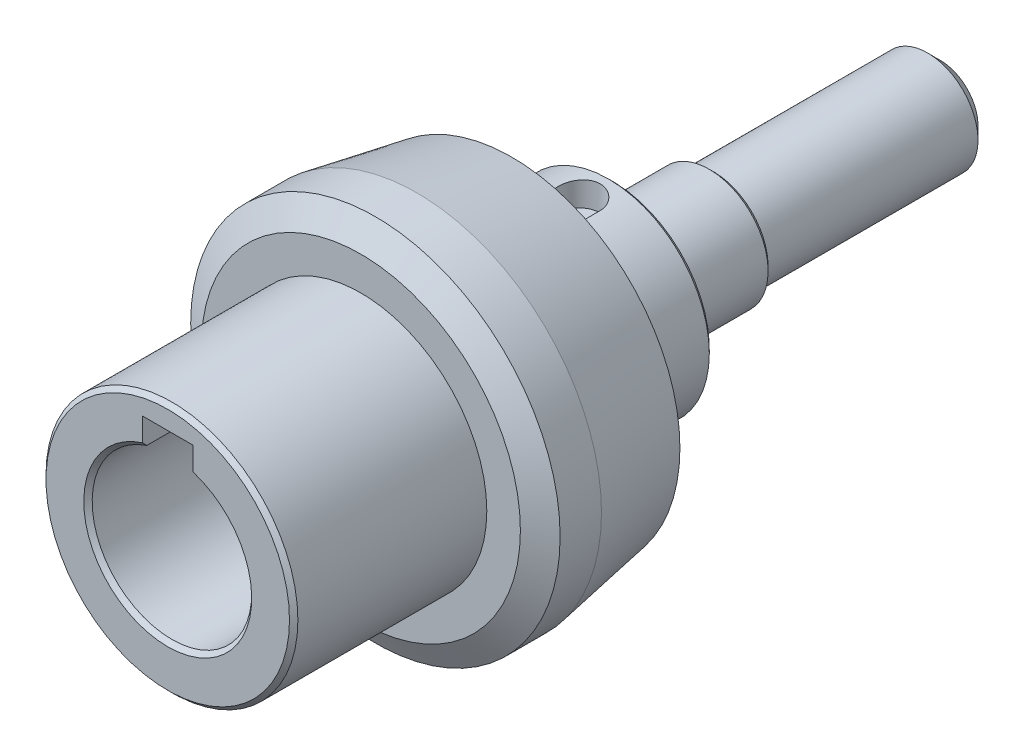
ISO-10303-21;
HEADER;
FILE_DESCRIPTION(('STEP AP214'),'2;1');
FILE_NAME('part.step','',(''),(''),'','','');
FILE_SCHEMA(('AUTOMOTIVE_DESIGN { 1 0 10303 214 1 1 1 1 }'));
ENDSEC;
DATA;
#1=APPLICATION_CONTEXT('core data for automotive mechanical design processes');
#2=APPLICATION_PROTOCOL_DEFINITION('international standard','automotive_design',2000,#1);
#3=PRODUCT_CONTEXT('',#1,'mechanical');
#4=PRODUCT('Part','Part','',(#3));
#5=PRODUCT_RELATED_PRODUCT_CATEGORY('part','',(#4));
#6=PRODUCT_DEFINITION_FORMATION('','',#4);
#7=PRODUCT_DEFINITION_CONTEXT('part definition',#1,'design');
#8=PRODUCT_DEFINITION('design','',#6,#7);
#9=PRODUCT_DEFINITION_SHAPE('','',#8);
#10=(LENGTH_UNIT() NAMED_UNIT(*) SI_UNIT(.MILLI.,.METRE.));
#11=(NAMED_UNIT(*) PLANE_ANGLE_UNIT() SI_UNIT($,.RADIAN.));
#12=(NAMED_UNIT(*) SI_UNIT($,.STERADIAN.) SOLID_ANGLE_UNIT());
#13=UNCERTAINTY_MEASURE_WITH_UNIT(LENGTH_MEASURE(1.E-05),#10,'distance_accuracy_value','');
#14=(GEOMETRIC_REPRESENTATION_CONTEXT(3) GLOBAL_UNCERTAINTY_ASSIGNED_CONTEXT((#13)) GLOBAL_UNIT_ASSIGNED_CONTEXT((#10,
#11,#12)) REPRESENTATION_CONTEXT('',''));
#15=CARTESIAN_POINT('',(0.,0.,0.));
#16=DIRECTION('',(0.,0.,1.));
#17=DIRECTION('',(1.,0.,0.));
#18=AXIS2_PLACEMENT_3D('',#15,#16,#17);
#19=CARTESIAN_POINT('',(0.,0.,2.50000000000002));
#20=DIRECTION('',(0.,0.,1.));
#21=DIRECTION('',(1.,0.,0.));
#22=AXIS2_PLACEMENT_3D('',#19,#20,#21);
#23=CYLINDRICAL_SURFACE('',#22,9.5);
#24=DIRECTION('',(0.,0.,1.));
#25=VECTOR('',#24,1.);
#26=CARTESIAN_POINT('',(-3.,9.01387818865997,2.50000000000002));
#27=LINE('',#26,#25);
#28=CARTESIAN_POINT('',(-3.,9.01387818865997,13.));
#29=VERTEX_POINT('',#28);
#30=CARTESIAN_POINT('',(-3.,9.01387818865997,40.5));
#31=VERTEX_POINT('',#30);
#32=EDGE_CURVE('E147',#29,#31,#27,.T.);
#33=ORIENTED_EDGE('',*,*,#32,.T.);
#34=CARTESIAN_POINT('',(0.,0.,40.5));
#35=DIRECTION('',(0.,0.,1.));
#36=DIRECTION('',(1.,0.,0.));
#37=AXIS2_PLACEMENT_3D('',#34,#35,#36);
#38=CIRCLE('',#37,9.5);
#39=CARTESIAN_POINT('',(3.,9.01387818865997,40.5));
#40=VERTEX_POINT('',#39);
#41=EDGE_CURVE('E212',#31,#40,#38,.T.);
#42=ORIENTED_EDGE('',*,*,#41,.T.);
#43=DIRECTION('',(0.,0.,1.));
#44=VECTOR('',#43,1.);
#45=CARTESIAN_POINT('',(3.,9.01387818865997,2.50000000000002));
#46=LINE('',#45,#44);
#47=CARTESIAN_POINT('',(3.,9.01387818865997,13.));
#48=VERTEX_POINT('',#47);
#49=EDGE_CURVE('E143',#40,#48,#46,.F.);
#50=ORIENTED_EDGE('',*,*,#49,.T.);
#51=CARTESIAN_POINT('',(0.,0.,13.));
#52=DIRECTION('',(0.,0.,1.));
#53=DIRECTION('',(1.,0.,0.));
#54=AXIS2_PLACEMENT_3D('',#51,#52,#53);
#55=CIRCLE('',#54,9.5);
#56=EDGE_CURVE('E161',#48,#29,#55,.F.);
#57=ORIENTED_EDGE('',*,*,#56,.T.);
#58=EDGE_LOOP('',(#33,#42,#50,#57));
#59=FACE_BOUND('',#58,.T.);
#60=ADVANCED_FACE('F26',(#59),#23,.F.);
#61=CARTESIAN_POINT('',(0.,0.,0.));
#62=DIRECTION('',(0.,0.,1.));
#63=DIRECTION('',(1.,0.,0.));
#64=AXIS2_PLACEMENT_3D('',#61,#62,#63);
#65=PLANE('',#64);
#66=CARTESIAN_POINT('',(0.,0.,0.));
#67=DIRECTION('',(0.,0.,1.));
#68=DIRECTION('',(1.,0.,0.));
#69=AXIS2_PLACEMENT_3D('',#66,#67,#68);
#70=CIRCLE('',#69,19.9999999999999);
#71=CARTESIAN_POINT('',(19.9999999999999,0.,0.));
#72=VERTEX_POINT('',#71);
#73=EDGE_CURVE('E175',#72,#72,#70,.F.);
#74=ORIENTED_EDGE('',*,*,#73,.T.);
#75=EDGE_LOOP('',(#74));
#76=FACE_BOUND('',#75,.T.);
#77=CARTESIAN_POINT('',(0.,0.,0.));
#78=DIRECTION('',(0.,0.,-1.));
#79=DIRECTION('',(-1.,0.,0.));
#80=AXIS2_PLACEMENT_3D('',#77,#78,#79);
#81=CIRCLE('',#80,12.);
#82=CARTESIAN_POINT('',(-12.,0.,0.));
#83=VERTEX_POINT('',#82);
#84=EDGE_CURVE('E172',#83,#83,#81,.T.);
#85=ORIENTED_EDGE('',*,*,#84,.F.);
#86=EDGE_LOOP('',(#85));
#87=FACE_BOUND('',#86,.T.);
#88=ADVANCED_FACE('F323',(#76,#87),#65,.F.);
#89=CARTESIAN_POINT('',(0.,0.,18.));
#90=DIRECTION('',(0.,0.,-1.));
#91=DIRECTION('',(-1.,0.,0.));
#92=AXIS2_PLACEMENT_3D('',#89,#90,#91);
#93=CYLINDRICAL_SURFACE('',#92,22.);
#94=CARTESIAN_POINT('',(0.,0.,16.2679491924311));
#95=DIRECTION('',(0.,0.,1.));
#96=DIRECTION('',(1.,0.,0.));
#97=AXIS2_PLACEMENT_3D('',#94,#95,#96);
#98=CIRCLE('',#97,22.);
#99=CARTESIAN_POINT('',(22.,0.,16.2679491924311));
#100=VERTEX_POINT('',#99);
#101=EDGE_CURVE('E335',#100,#100,#98,.F.);
#102=ORIENTED_EDGE('',*,*,#101,.T.);
#103=EDGE_LOOP('',(#102));
#104=FACE_BOUND('',#103,.T.);
#105=CARTESIAN_POINT('',(0.,0.,11.3425636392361));
#106=DIRECTION('',(0.,0.,1.));
#107=DIRECTION('',(1.,0.,0.));
#108=AXIS2_PLACEMENT_3D('',#105,#106,#107);
#109=CIRCLE('',#108,22.);
#110=CARTESIAN_POINT('',(22.,0.,11.3425636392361));
#111=VERTEX_POINT('',#110);
#112=EDGE_CURVE('E160',#111,#111,#109,.T.);
#113=ORIENTED_EDGE('',*,*,#112,.T.);
#114=EDGE_LOOP('',(#113));
#115=FACE_BOUND('',#114,.T.);
#116=ADVANCED_FACE('F28',(#104,#115),#93,.T.);
#117=CARTESIAN_POINT('',(0.,0.,18.));
#118=DIRECTION('',(0.,0.,1.));
#119=DIRECTION('',(1.,0.,0.));
#120=AXIS2_PLACEMENT_3D('',#117,#118,#119);
#121=PLANE('',#120);
#122=CARTESIAN_POINT('',(0.,0.,18.));
#123=DIRECTION('',(0.,0.,1.));
#124=DIRECTION('',(1.,0.,0.));
#125=AXIS2_PLACEMENT_3D('',#122,#123,#124);
#126=CIRCLE('',#125,19.);
#127=CARTESIAN_POINT('',(19.,0.,18.));
#128=VERTEX_POINT('',#127);
#129=EDGE_CURVE('E333',#128,#128,#126,.T.);
#130=ORIENTED_EDGE('',*,*,#129,.T.);
#131=EDGE_LOOP('',(#130));
#132=FACE_BOUND('',#131,.T.);
#133=CARTESIAN_POINT('',(0.,0.,18.));
#134=DIRECTION('',(0.,0.,1.));
#135=DIRECTION('',(1.,0.,0.));
#136=AXIS2_PLACEMENT_3D('',#133,#134,#135);
#137=CIRCLE('',#136,15.);
#138=CARTESIAN_POINT('',(15.,0.,18.));
#139=VERTEX_POINT('',#138);
#140=EDGE_CURVE('E162',#139,#139,#137,.T.);
#141=ORIENTED_EDGE('',*,*,#140,.F.);
#142=EDGE_LOOP('',(#141));
#143=FACE_BOUND('',#142,.T.);
#144=ADVANCED_FACE('F504',(#132,#143),#121,.T.);
#145=CARTESIAN_POINT('',(0.,0.,11.3425636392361));
#146=DIRECTION('',(0.,0.,1.));
#147=DIRECTION('',(1.,0.,0.));
#148=AXIS2_PLACEMENT_3D('',#145,#146,#147);
#149=CONICAL_SURFACE('',#148,22.,0.17453292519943);
#150=CARTESIAN_POINT('',(19.9999999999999,0.,0.));
#151=CARTESIAN_POINT('',(20.0208333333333,0.,0.118151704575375));
#152=CARTESIAN_POINT('',(20.0416666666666,0.,0.236303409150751));
#153=CARTESIAN_POINT('',(20.0833333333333,0.,0.472606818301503));
#154=CARTESIAN_POINT('',(20.1041666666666,0.,0.590758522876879));
#155=CARTESIAN_POINT('',(20.1458333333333,0.,0.82706193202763));
#156=CARTESIAN_POINT('',(20.1666666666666,0.,0.945213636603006));
#157=CARTESIAN_POINT('',(20.2083333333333,0.,1.18151704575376));
#158=CARTESIAN_POINT('',(20.2291666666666,0.,1.29966875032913));
#159=CARTESIAN_POINT('',(20.2708333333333,0.,1.53597215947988));
#160=CARTESIAN_POINT('',(20.2916666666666,0.,1.65412386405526));
#161=CARTESIAN_POINT('',(20.3333333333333,0.,1.89042727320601));
#162=CARTESIAN_POINT('',(20.3541666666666,0.,2.00857897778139));
#163=CARTESIAN_POINT('',(20.3958333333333,0.,2.24488238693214));
#164=CARTESIAN_POINT('',(20.4166666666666,0.,2.36303409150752));
#165=CARTESIAN_POINT('',(20.4583333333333,0.,2.59933750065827));
#166=CARTESIAN_POINT('',(20.4791666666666,0.,2.71748920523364));
#167=CARTESIAN_POINT('',(20.5208333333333,0.,2.95379261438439));
#168=CARTESIAN_POINT('',(20.5416666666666,0.,3.07194431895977));
#169=CARTESIAN_POINT('',(20.5833333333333,0.,3.30824772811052));
#170=CARTESIAN_POINT('',(20.6041666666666,0.,3.4263994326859));
#171=CARTESIAN_POINT('',(20.6458333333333,0.,3.66270284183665));
#172=CARTESIAN_POINT('',(20.6666666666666,0.,3.78085454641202));
#173=CARTESIAN_POINT('',(20.7083333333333,0.,4.01715795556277));
#174=CARTESIAN_POINT('',(20.7291666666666,0.,4.13530966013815));
#175=CARTESIAN_POINT('',(20.7708333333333,0.,4.3716130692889));
#176=CARTESIAN_POINT('',(20.7916666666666,0.,4.48976477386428));
#177=CARTESIAN_POINT('',(20.8333333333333,0.,4.72606818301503));
#178=CARTESIAN_POINT('',(20.8541666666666,0.,4.84421988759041));
#179=CARTESIAN_POINT('',(20.8958333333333,0.,5.08052329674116));
#180=CARTESIAN_POINT('',(20.9166666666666,0.,5.19867500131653));
#181=CARTESIAN_POINT('',(20.9583333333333,0.,5.43497841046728));
#182=CARTESIAN_POINT('',(20.9791666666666,0.,5.55313011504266));
#183=CARTESIAN_POINT('',(21.0208333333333,0.,5.78943352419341));
#184=CARTESIAN_POINT('',(21.0416666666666,0.,5.90758522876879));
#185=CARTESIAN_POINT('',(21.0833333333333,0.,6.14388863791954));
#186=CARTESIAN_POINT('',(21.1041666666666,0.,6.26204034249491));
#187=CARTESIAN_POINT('',(21.1458333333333,0.,6.49834375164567));
#188=CARTESIAN_POINT('',(21.1666666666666,0.,6.61649545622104));
#189=CARTESIAN_POINT('',(21.2083333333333,0.,6.85279886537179));
#190=CARTESIAN_POINT('',(21.2291666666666,0.,6.97095056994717));
#191=CARTESIAN_POINT('',(21.2708333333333,0.,7.20725397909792));
#192=CARTESIAN_POINT('',(21.2916666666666,0.,7.32540568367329));
#193=CARTESIAN_POINT('',(21.3333333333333,0.,7.56170909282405));
#194=CARTESIAN_POINT('',(21.3541666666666,0.,7.67986079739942));
#195=CARTESIAN_POINT('',(21.3958333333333,0.,7.91616420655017));
#196=CARTESIAN_POINT('',(21.4166666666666,0.,8.03431591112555));
#197=CARTESIAN_POINT('',(21.4583333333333,0.,8.2706193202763));
#198=CARTESIAN_POINT('',(21.4791666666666,0.,8.38877102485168));
#199=CARTESIAN_POINT('',(21.5208333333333,0.,8.62507443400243));
#200=CARTESIAN_POINT('',(21.5416666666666,0.,8.7432261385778));
#201=CARTESIAN_POINT('',(21.5833333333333,0.,8.97952954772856));
#202=CARTESIAN_POINT('',(21.6041666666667,0.,9.09768125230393));
#203=CARTESIAN_POINT('',(21.6458333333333,0.,9.33398466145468));
#204=CARTESIAN_POINT('',(21.6666666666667,0.,9.45213636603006));
#205=CARTESIAN_POINT('',(21.7083333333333,0.,9.68843977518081));
#206=CARTESIAN_POINT('',(21.7291666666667,0.,9.80659147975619));
#207=CARTESIAN_POINT('',(21.7708333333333,0.,10.0428948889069));
#208=CARTESIAN_POINT('',(21.7916666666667,0.,10.1610465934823));
#209=CARTESIAN_POINT('',(21.8333333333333,0.,10.3973500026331));
#210=CARTESIAN_POINT('',(21.8541666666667,0.,10.5155017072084));
#211=CARTESIAN_POINT('',(21.8958333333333,0.,10.7518051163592));
#212=CARTESIAN_POINT('',(21.9166666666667,0.,10.8699568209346));
#213=CARTESIAN_POINT('',(21.9583333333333,0.,11.1062602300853));
#214=CARTESIAN_POINT('',(21.9791666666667,0.,11.2244119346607));
#215=CARTESIAN_POINT('',(22.,0.,11.3425636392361));
#216=B_SPLINE_CURVE_WITH_KNOTS('',3,(#150,#151,#152,#153,#154,#155,#156,#157,#158,#159,#160,
#161,#162,#163,#164,#165,#166,#167,#168,#169,#170,#171,#172,#173,#174,#175,#176,#177,#178,#179,
#180,#181,#182,#183,#184,#185,#186,#187,#188,#189,#190,#191,#192,#193,#194,#195,#196,#197,#198,
#199,#200,#201,#202,#203,#204,#205,#206,#207,#208,#209,#210,#211,#212,#213,#214,#215),
.UNSPECIFIED.,.F.,.F.,(4,2,2,2,2,2,2,2,2,2,2,2,2,2,2,2,2,2,2,2,2,2,2,2,2,2,2,2,2,2,2,2,4),(0.,
0.359923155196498,0.719846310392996,1.07976946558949,1.43969262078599,1.79961577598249,
2.15953893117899,2.51946208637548,2.87938524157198,3.23930839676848,3.59923155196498,
3.95915470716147,4.31907786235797,4.67900101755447,5.03892417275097,5.39884732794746,
5.75877048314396,6.11869363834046,6.47861679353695,6.83853994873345,7.19846310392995,
7.55838625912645,7.91830941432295,8.27823256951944,8.63815572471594,8.99807887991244,
9.35800203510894,9.71792519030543,10.0778483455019,10.4377715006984,10.7976946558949,
11.1576178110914,11.5175409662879),.UNSPECIFIED.);
#217=EDGE_CURVE('BSEAM291',#72,#111,#216,.T.);
#218=ORIENTED_EDGE('',*,*,#73,.F.);
#219=ORIENTED_EDGE('',*,*,#112,.F.);
#220=ORIENTED_EDGE('',*,*,#217,.T.);
#221=ORIENTED_EDGE('',*,*,#217,.F.);
#222=EDGE_LOOP('',(#218,#220,#219,#221));
#223=FACE_BOUND('',#222,.T.);
#224=ADVANCED_FACE('F291',(#223),#149,.T.);
#225=CARTESIAN_POINT('',(0.,0.,-12.));
#226=DIRECTION('',(0.,0.,1.));
#227=DIRECTION('',(1.,0.,0.));
#228=AXIS2_PLACEMENT_3D('',#225,#226,#227);
#229=CYLINDRICAL_SURFACE('',#228,12.);
#230=CARTESIAN_POINT('',(0.,12.,-0.454275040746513));
#231=CARTESIAN_POINT('',(-0.141297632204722,11.9999973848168,-0.454280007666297));
#232=CARTESIAN_POINT('',(-0.282656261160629,11.9974789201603,-0.466078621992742));
#233=CARTESIAN_POINT('',(-0.561365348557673,11.9876753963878,-0.51291651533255));
#234=CARTESIAN_POINT('',(-0.698712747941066,11.9803867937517,-0.547973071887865));
#235=CARTESIAN_POINT('',(-0.965330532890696,11.9618553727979,-0.640185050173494));
#236=CARTESIAN_POINT('',(-1.09460895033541,11.9506165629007,-0.69731807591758));
#237=CARTESIAN_POINT('',(-1.34173901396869,11.9254008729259,-0.831991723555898));
#238=CARTESIAN_POINT('',(-1.4595910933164,11.9114240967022,-0.909531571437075));
#239=CARTESIAN_POINT('',(-1.68231414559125,11.8820295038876,-1.08406139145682));
#240=CARTESIAN_POINT('',(-1.78698722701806,11.8665947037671,-1.18130106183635));
#241=CARTESIAN_POINT('',(-1.97866594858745,11.8361447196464,-1.39193392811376));
#242=CARTESIAN_POINT('',(-2.06567008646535,11.8211295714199,-1.50532849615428));
#243=CARTESIAN_POINT('',(-2.22040318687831,11.7930521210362,-1.74650115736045));
#244=CARTESIAN_POINT('',(-2.28792355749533,11.7800116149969,-1.87441584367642));
#245=CARTESIAN_POINT('',(-2.40043507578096,11.7576028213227,-2.14009791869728));
#246=CARTESIAN_POINT('',(-2.44542874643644,11.7482341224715,-2.27786420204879));
#247=CARTESIAN_POINT('',(-2.51095980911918,11.7344022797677,-2.55719834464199));
#248=CARTESIAN_POINT('',(-2.53184644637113,11.7298691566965,-2.69868073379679));
#249=CARTESIAN_POINT('',(-2.54965607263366,11.7260113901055,-2.98320855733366));
#250=CARTESIAN_POINT('',(-2.546581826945,11.7266861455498,-3.12625380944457));
#251=CARTESIAN_POINT('',(-2.51683848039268,11.7331044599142,-3.40726546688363));
#252=CARTESIAN_POINT('',(-2.49057314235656,11.7387612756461,-3.54527688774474));
#253=CARTESIAN_POINT('',(-2.41583201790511,11.7543693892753,-3.81488879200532));
#254=CARTESIAN_POINT('',(-2.36735505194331,11.7643209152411,-3.94648893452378));
#255=CARTESIAN_POINT('',(-2.24919069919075,11.7874837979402,-4.20068798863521));
#256=CARTESIAN_POINT('',(-2.1793463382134,11.800719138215,-4.32321165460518));
#257=CARTESIAN_POINT('',(-2.02054033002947,11.8289434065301,-4.55494995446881));
#258=CARTESIAN_POINT('',(-1.93157622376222,11.8439325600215,-4.66416287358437));
#259=CARTESIAN_POINT('',(-1.73490992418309,11.8743490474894,-4.86850603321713));
#260=CARTESIAN_POINT('',(-1.62686392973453,11.889779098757,-4.96330529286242));
#261=CARTESIAN_POINT('',(-1.39623530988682,11.9190610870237,-5.13349019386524));
#262=CARTESIAN_POINT('',(-1.27365245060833,11.9329129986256,-5.20887552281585));
#263=CARTESIAN_POINT('',(-1.01703893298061,11.9575188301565,-5.33816695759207));
#264=CARTESIAN_POINT('',(-0.88298682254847,11.9682667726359,-5.39203169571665));
#265=CARTESIAN_POINT('',(-0.607456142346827,11.985408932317,-5.47638098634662));
#266=CARTESIAN_POINT('',(-0.465978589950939,11.9918037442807,-5.5068687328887));
#267=CARTESIAN_POINT('',(-0.182453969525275,11.9994351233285,-5.54312183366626));
#268=CARTESIAN_POINT('',(-0.0404672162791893,12.0007660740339,-5.5493396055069));
#269=CARTESIAN_POINT('',(0.242516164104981,11.9983834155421,-5.53809968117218));
#270=CARTESIAN_POINT('',(0.383512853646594,11.9946701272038,-5.52064349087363));
#271=CARTESIAN_POINT('',(0.659028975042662,11.9826756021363,-5.46292659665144));
#272=CARTESIAN_POINT('',(0.793599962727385,11.974441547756,-5.42290132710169));
#273=CARTESIAN_POINT('',(1.05411911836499,11.954326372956,-5.32144230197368));
#274=CARTESIAN_POINT('',(1.18006658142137,11.9424449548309,-5.26000679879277));
#275=CARTESIAN_POINT('',(1.42164775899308,11.9161192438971,-5.11651560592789));
#276=CARTESIAN_POINT('',(1.53711856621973,11.9016424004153,-5.03419174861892));
#277=CARTESIAN_POINT('',(1.75276906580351,11.871801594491,-4.85161597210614));
#278=CARTESIAN_POINT('',(1.85294689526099,11.8564375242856,-4.75136187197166));
#279=CARTESIAN_POINT('',(2.03694116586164,11.8262306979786,-4.53370113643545));
#280=CARTESIAN_POINT('',(2.12044526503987,11.8114015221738,-4.41602824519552));
#281=CARTESIAN_POINT('',(2.2665059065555,11.7842476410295,-4.16806186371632));
#282=CARTESIAN_POINT('',(2.32906333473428,11.7719228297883,-4.03776890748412));
#283=CARTESIAN_POINT('',(2.43104574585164,11.751286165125,-3.76894758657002));
#284=CARTESIAN_POINT('',(2.47059762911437,11.7429523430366,-3.63046913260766));
#285=CARTESIAN_POINT('',(2.52582310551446,11.7311989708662,-3.34863357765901));
#286=CARTESIAN_POINT('',(2.54150025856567,11.7277786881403,-3.20527720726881));
#287=CARTESIAN_POINT('',(2.54838679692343,11.7262838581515,-2.92089945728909));
#288=CARTESIAN_POINT('',(2.54009077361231,11.7281012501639,-2.77989039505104));
#289=CARTESIAN_POINT('',(2.50036705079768,11.7366336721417,-2.5013278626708));
#290=CARTESIAN_POINT('',(2.46893959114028,11.7433486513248,-2.36377435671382));
#291=CARTESIAN_POINT('',(2.38407756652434,11.7608685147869,-2.09639224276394));
#292=CARTESIAN_POINT('',(2.33071090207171,11.7716607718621,-1.96654120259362));
#293=CARTESIAN_POINT('',(2.2035452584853,11.7961248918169,-1.71756084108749));
#294=CARTESIAN_POINT('',(2.12974429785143,11.8097970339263,-1.59843256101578));
#295=CARTESIAN_POINT('',(1.96214691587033,11.8388060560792,-1.37183219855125));
#296=CARTESIAN_POINT('',(1.86799629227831,11.8541696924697,-1.26462546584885));
#297=CARTESIAN_POINT('',(1.66309498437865,11.8846465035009,-1.06737008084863));
#298=CARTESIAN_POINT('',(1.55234047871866,11.8997596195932,-0.977325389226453));
#299=CARTESIAN_POINT('',(1.31576888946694,11.9282480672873,-0.815916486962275));
#300=CARTESIAN_POINT('',(1.18978643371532,11.941600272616,-0.744790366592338));
#301=CARTESIAN_POINT('',(0.9274018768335,11.9648322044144,-0.624834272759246));
#302=CARTESIAN_POINT('',(0.791008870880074,11.9747149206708,-0.575985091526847));
#303=CARTESIAN_POINT('',(0.545346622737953,11.9880740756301,-0.510949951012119));
#304=CARTESIAN_POINT('',(0.437432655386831,11.9925191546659,-0.489736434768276));
#305=CARTESIAN_POINT('',(0.21969136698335,11.9984830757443,-0.461397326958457));
#306=CARTESIAN_POINT('',(0.109864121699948,12.0000020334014,-0.454271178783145));
#307=CARTESIAN_POINT('',(0.,12.,-0.454275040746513));
#308=B_SPLINE_CURVE_WITH_KNOTS('',3,(#230,#231,#232,#233,#234,#235,#236,#237,#238,#239,#240,
#241,#242,#243,#244,#245,#246,#247,#248,#249,#250,#251,#252,#253,#254,#255,#256,#257,#258,#259,
#260,#261,#262,#263,#264,#265,#266,#267,#268,#269,#270,#271,#272,#273,#274,#275,#276,#277,#278,
#279,#280,#281,#282,#283,#284,#285,#286,#287,#288,#289,#290,#291,#292,#293,#294,#295,#296,#297,
#298,#299,#300,#301,#302,#303,#304,#305,#306,#307),.UNSPECIFIED.,.T.,.F.,(4,2,2,2,2,2,2,2,2,2,2,
2,2,2,2,2,2,2,2,2,2,2,2,2,2,2,2,2,2,2,2,2,2,2,2,2,2,2,4),(0.,0.423490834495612,
0.847296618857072,1.27067358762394,1.69403450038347,2.12314136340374,2.55228469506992,
2.98586505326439,3.4193968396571,3.84656581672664,4.27368549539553,4.69351238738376,
5.1133615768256,5.53637240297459,5.95943766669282,6.39109337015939,6.82275601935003,
7.25524448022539,7.68767383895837,8.11200264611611,8.53630446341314,8.9562598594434,
9.37624954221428,9.801931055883,10.2276643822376,10.6607480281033,11.0938133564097,
11.5244666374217,11.9550556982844,12.376825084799,12.7985900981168,13.2190594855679,
13.6395696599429,14.0680922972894,14.4967137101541,14.9304982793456,15.3639081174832,
15.6932008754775,16.0224806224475),.UNSPECIFIED.);
#309=CARTESIAN_POINT('',(2.5,11.7366945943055,-3.48032860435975));
#310=VERTEX_POINT('',#309);
#311=CARTESIAN_POINT('',(-2.17535328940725,11.801179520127,-4.32232886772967));
#312=VERTEX_POINT('',#311);
#313=EDGE_CURVE('E103',#310,#312,#308,.T.);
#314=ORIENTED_EDGE('',*,*,#313,.T.);
#315=DIRECTION('',(0.,0.,1.));
#316=VECTOR('',#315,1.);
#317=CARTESIAN_POINT('',(-2.17535328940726,11.801179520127,-12.));
#318=LINE('',#317,#316);
#319=CARTESIAN_POINT('',(-2.17535328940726,11.801179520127,-6.76799429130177));
#320=VERTEX_POINT('',#319);
#321=EDGE_CURVE('E344',#312,#320,#318,.F.);
#322=ORIENTED_EDGE('',*,*,#321,.T.);
#323=CARTESIAN_POINT('',(-2.17535328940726,11.801179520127,-6.76799429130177));
#324=CARTESIAN_POINT('',(-2.20943091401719,11.7948954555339,-6.82815272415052));
#325=CARTESIAN_POINT('',(-2.24101588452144,11.788922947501,-6.88975505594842));
#326=CARTESIAN_POINT('',(-2.29899877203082,11.7777540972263,-7.01542587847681));
#327=CARTESIAN_POINT('',(-2.32539639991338,11.7725577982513,-7.07949450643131));
#328=CARTESIAN_POINT('',(-2.37279104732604,11.7630967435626,-7.209647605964));
#329=CARTESIAN_POINT('',(-2.39378987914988,11.7588316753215,-7.27573139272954));
#330=CARTESIAN_POINT('',(-2.43023820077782,11.75135235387,-7.40944805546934));
#331=CARTESIAN_POINT('',(-2.44568793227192,11.7481380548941,-7.47708086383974));
#332=CARTESIAN_POINT('',(-2.48353143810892,11.7402211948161,-7.68174800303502));
#333=CARTESIAN_POINT('',(-2.4974139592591,11.7372458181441,-7.8205357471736));
#334=CARTESIAN_POINT('',(-2.50192839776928,11.736283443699,-8.09837186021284));
#335=CARTESIAN_POINT('',(-2.49257064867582,11.73829422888,-8.237420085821));
#336=CARTESIAN_POINT('',(-2.45115475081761,11.7470113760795,-8.51063137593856));
#337=CARTESIAN_POINT('',(-2.41930730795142,11.7536741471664,-8.64482772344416));
#338=CARTESIAN_POINT('',(-2.33411383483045,11.7708872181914,-8.90597447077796));
#339=CARTESIAN_POINT('',(-2.28076135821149,11.7814386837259,-9.03292268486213));
#340=CARTESIAN_POINT('',(-2.15345392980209,11.8053740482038,-9.27743157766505));
#341=CARTESIAN_POINT('',(-2.07928995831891,11.8187863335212,-9.3948805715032));
#342=CARTESIAN_POINT('',(-1.91266893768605,11.8468905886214,-9.61581107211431));
#343=CARTESIAN_POINT('',(-1.82021122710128,11.8615826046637,-9.71929207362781));
#344=CARTESIAN_POINT('',(-1.61755766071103,11.8909277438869,-9.91137613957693));
#345=CARTESIAN_POINT('',(-1.50706168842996,11.9055749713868,-9.99966382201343));
#346=CARTESIAN_POINT('',(-1.27260645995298,11.9329116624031,-10.1564695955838));
#347=CARTESIAN_POINT('',(-1.14864701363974,11.9456010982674,-10.224987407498));
#348=CARTESIAN_POINT('',(-0.890905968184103,11.9675798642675,-10.3401219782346));
#349=CARTESIAN_POINT('',(-0.75714158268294,11.9768749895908,-10.3867761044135));
#350=CARTESIAN_POINT('',(-0.483442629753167,11.991040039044,-10.4568744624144));
#351=CARTESIAN_POINT('',(-0.343508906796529,11.9959105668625,-10.4803218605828));
#352=CARTESIAN_POINT('',(-0.0642670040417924,12.0006251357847,-10.5030229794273));
#353=CARTESIAN_POINT('',(0.0750034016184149,12.0005620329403,-10.5027236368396));
#354=CARTESIAN_POINT('',(0.351474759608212,11.9956484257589,-10.4790547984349));
#355=CARTESIAN_POINT('',(0.48867583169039,11.990798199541,-10.455686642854));
#356=CARTESIAN_POINT('',(0.756179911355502,11.9768953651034,-10.3868679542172));
#357=CARTESIAN_POINT('',(0.88652370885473,11.9678717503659,-10.3415696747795));
#358=CARTESIAN_POINT('',(1.13779700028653,11.946603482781,-10.2303145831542));
#359=CARTESIAN_POINT('',(1.25872515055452,11.9343583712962,-10.1643548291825));
#360=CARTESIAN_POINT('',(1.48975291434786,11.9077445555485,-10.0124708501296));
#361=CARTESIAN_POINT('',(1.59965782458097,11.8933461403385,-9.92625572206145));
#362=CARTESIAN_POINT('',(1.80358224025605,11.8641359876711,-9.73679724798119));
#363=CARTESIAN_POINT('',(1.89760142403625,11.8493242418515,-9.63355355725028));
#364=CARTESIAN_POINT('',(2.06850022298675,11.8206998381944,-9.41112077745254));
#365=CARTESIAN_POINT('',(2.14510551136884,11.8069052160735,-9.29171826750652));
#366=CARTESIAN_POINT('',(2.27713372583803,11.7821558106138,-9.04147699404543));
#367=CARTESIAN_POINT('',(2.33256040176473,11.7712005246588,-8.91064026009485));
#368=CARTESIAN_POINT('',(2.41728846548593,11.754082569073,-8.65110466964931));
#369=CARTESIAN_POINT('',(2.44821336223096,11.7476263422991,-8.52295809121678));
#370=CARTESIAN_POINT('',(2.47923434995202,11.7411028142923,-8.32823720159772));
#371=CARTESIAN_POINT('',(2.4870136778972,11.7394550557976,-8.2628584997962));
#372=CARTESIAN_POINT('',(2.49739734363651,11.7372492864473,-8.13166243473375));
#373=CARTESIAN_POINT('',(2.50000083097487,11.7366914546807,-8.06584500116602));
#374=CARTESIAN_POINT('',(2.5,11.7366945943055,-8.00000000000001));
#375=B_SPLINE_CURVE_WITH_KNOTS('',3,(#323,#324,#325,#326,#327,#328,#329,#330,#331,#332,#333,
#334,#335,#336,#337,#338,#339,#340,#341,#342,#343,#344,#345,#346,#347,#348,#349,#350,#351,#352,
#353,#354,#355,#356,#357,#358,#359,#360,#361,#362,#363,#364,#365,#366,#367,#368,#369,#370,#371,
#372,#373,#374),.UNSPECIFIED.,.F.,.F.,(4,2,2,2,2,2,2,2,2,2,2,2,2,2,2,2,2,2,2,2,2,2,2,2,2,4),(0.,
0.208212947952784,0.416437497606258,0.624592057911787,0.832737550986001,1.24907687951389,
1.66523112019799,2.07753727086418,2.48996710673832,2.90669731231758,3.32344258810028,
3.74800274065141,4.17256888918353,4.59640673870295,5.02018675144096,5.43599274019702,
5.85177457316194,6.26471028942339,6.67770482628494,7.09703859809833,7.51638085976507,
7.94193080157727,8.36740536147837,8.76154292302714,8.95893725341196,9.15636401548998),.UNSPECIFIED.);
#376=CARTESIAN_POINT('',(2.5,11.7366945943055,-8.));
#377=VERTEX_POINT('',#376);
#378=EDGE_CURVE('E296',#320,#377,#375,.T.);
#379=ORIENTED_EDGE('',*,*,#378,.T.);
#380=DIRECTION('',(0.,0.,1.));
#381=VECTOR('',#380,1.);
#382=CARTESIAN_POINT('',(2.5,11.7366945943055,-12.));
#383=LINE('',#382,#381);
#384=EDGE_CURVE('E307',#377,#310,#383,.T.);
#385=ORIENTED_EDGE('',*,*,#384,.T.);
#386=EDGE_LOOP('',(#314,#322,#379,#385));
#387=FACE_BOUND('',#386,.T.);
#388=CARTESIAN_POINT('',(0.,0.,-11.5));
#389=DIRECTION('',(0.,0.,-1.));
#390=DIRECTION('',(-1.,0.,0.));
#391=AXIS2_PLACEMENT_3D('',#388,#389,#390);
#392=CIRCLE('',#391,12.);
#393=CARTESIAN_POINT('',(-12.,0.,-11.5));
#394=VERTEX_POINT('',#393);
#395=EDGE_CURVE('E201',#394,#394,#392,.F.);
#396=ORIENTED_EDGE('',*,*,#395,.T.);
#397=EDGE_LOOP('',(#396));
#398=FACE_BOUND('',#397,.T.);
#399=ORIENTED_EDGE('',*,*,#84,.T.);
#400=EDGE_LOOP('',(#399));
#401=FACE_BOUND('',#400,.T.);
#402=ADVANCED_FACE('F286',(#387,#398,#401),#229,.T.);
#403=CARTESIAN_POINT('',(0.,0.,-12.));
#404=DIRECTION('',(0.,0.,-1.));
#405=DIRECTION('',(-1.,0.,0.));
#406=AXIS2_PLACEMENT_3D('',#403,#404,#405);
#407=PLANE('',#406);
#408=CARTESIAN_POINT('',(0.,0.,-12.));
#409=DIRECTION('',(0.,0.,-1.));
#410=DIRECTION('',(-1.,0.,0.));
#411=AXIS2_PLACEMENT_3D('',#408,#409,#410);
#412=CIRCLE('',#411,11.5);
#413=CARTESIAN_POINT('',(-11.5,0.,-12.));
#414=VERTEX_POINT('',#413);
#415=EDGE_CURVE('E198',#414,#414,#412,.T.);
#416=ORIENTED_EDGE('',*,*,#415,.T.);
#417=EDGE_LOOP('',(#416));
#418=FACE_BOUND('',#417,.T.);
#419=CARTESIAN_POINT('',(0.,0.,-12.));
#420=DIRECTION('',(0.,0.,-1.));
#421=DIRECTION('',(-1.,0.,0.));
#422=AXIS2_PLACEMENT_3D('',#419,#420,#421);
#423=CIRCLE('',#422,7.);
#424=CARTESIAN_POINT('',(-7.,0.,-12.));
#425=VERTEX_POINT('',#424);
#426=EDGE_CURVE('E169',#425,#425,#423,.T.);
#427=ORIENTED_EDGE('',*,*,#426,.F.);
#428=EDGE_LOOP('',(#427));
#429=FACE_BOUND('',#428,.T.);
#430=ADVANCED_FACE('F282',(#418,#429),#407,.T.);
#431=CARTESIAN_POINT('',(0.,0.,-24.));
#432=DIRECTION('',(0.,0.,1.));
#433=DIRECTION('',(1.,0.,0.));
#434=AXIS2_PLACEMENT_3D('',#431,#432,#433);
#435=CYLINDRICAL_SURFACE('',#434,7.);
#436=CARTESIAN_POINT('',(0.,0.,-23.5));
#437=DIRECTION('',(0.,0.,-1.));
#438=DIRECTION('',(-1.,0.,0.));
#439=AXIS2_PLACEMENT_3D('',#436,#437,#438);
#440=CIRCLE('',#439,7.);
#441=CARTESIAN_POINT('',(-7.,0.,-23.5));
#442=VERTEX_POINT('',#441);
#443=EDGE_CURVE('E195',#442,#442,#440,.F.);
#444=ORIENTED_EDGE('',*,*,#443,.T.);
#445=EDGE_LOOP('',(#444));
#446=FACE_BOUND('',#445,.T.);
#447=ORIENTED_EDGE('',*,*,#426,.T.);
#448=EDGE_LOOP('',(#447));
#449=FACE_BOUND('',#448,.T.);
#450=ADVANCED_FACE('F278',(#446,#449),#435,.T.);
#451=CARTESIAN_POINT('',(0.,0.,-24.));
#452=DIRECTION('',(0.,0.,-1.));
#453=DIRECTION('',(-1.,0.,0.));
#454=AXIS2_PLACEMENT_3D('',#451,#452,#453);
#455=PLANE('',#454);
#456=CARTESIAN_POINT('',(0.,0.,-24.));
#457=DIRECTION('',(0.,0.,-1.));
#458=DIRECTION('',(-1.,0.,0.));
#459=AXIS2_PLACEMENT_3D('',#456,#457,#458);
#460=CIRCLE('',#459,6.49999999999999);
#461=CARTESIAN_POINT('',(-6.49999999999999,0.,-24.));
#462=VERTEX_POINT('',#461);
#463=EDGE_CURVE('E192',#462,#462,#460,.T.);
#464=ORIENTED_EDGE('',*,*,#463,.T.);
#465=EDGE_LOOP('',(#464));
#466=FACE_BOUND('',#465,.T.);
#467=CARTESIAN_POINT('',(0.,0.,-24.));
#468=DIRECTION('',(0.,0.,-1.));
#469=DIRECTION('',(-1.,0.,0.));
#470=AXIS2_PLACEMENT_3D('',#467,#468,#469);
#471=CIRCLE('',#470,6.);
#472=CARTESIAN_POINT('',(-6.,0.,-24.));
#473=VERTEX_POINT('',#472);
#474=EDGE_CURVE('E166',#473,#473,#471,.T.);
#475=ORIENTED_EDGE('',*,*,#474,.F.);
#476=EDGE_LOOP('',(#475));
#477=FACE_BOUND('',#476,.T.);
#478=ADVANCED_FACE('F274',(#466,#477),#455,.T.);
#479=CARTESIAN_POINT('',(0.,0.,-51.));
#480=DIRECTION('',(0.,0.,1.));
#481=DIRECTION('',(1.,0.,0.));
#482=AXIS2_PLACEMENT_3D('',#479,#480,#481);
#483=CYLINDRICAL_SURFACE('',#482,6.);
#484=CARTESIAN_POINT('',(0.,0.,-49.5));
#485=DIRECTION('',(0.,0.,-1.));
#486=DIRECTION('',(-1.,0.,0.));
#487=AXIS2_PLACEMENT_3D('',#484,#485,#486);
#488=CIRCLE('',#487,6.);
#489=CARTESIAN_POINT('',(-6.,0.,-49.5));
#490=VERTEX_POINT('',#489);
#491=EDGE_CURVE('E11',#490,#490,#488,.F.);
#492=ORIENTED_EDGE('',*,*,#491,.T.);
#493=EDGE_LOOP('',(#492));
#494=FACE_BOUND('',#493,.T.);
#495=ORIENTED_EDGE('',*,*,#474,.T.);
#496=EDGE_LOOP('',(#495));
#497=FACE_BOUND('',#496,.T.);
#498=ADVANCED_FACE('F270',(#494,#497),#483,.T.);
#499=CARTESIAN_POINT('',(0.,0.,-51.));
#500=DIRECTION('',(0.,0.,-1.));
#501=DIRECTION('',(-1.,0.,0.));
#502=AXIS2_PLACEMENT_3D('',#499,#500,#501);
#503=PLANE('',#502);
#504=CARTESIAN_POINT('',(0.,0.,-51.));
#505=DIRECTION('',(0.,0.,-1.));
#506=DIRECTION('',(-1.,0.,0.));
#507=AXIS2_PLACEMENT_3D('',#504,#505,#506);
#508=CIRCLE('',#507,3.);
#509=CARTESIAN_POINT('',(-3.,0.,-51.));
#510=VERTEX_POINT('',#509);
#511=EDGE_CURVE('E121',#510,#510,#508,.T.);
#512=ORIENTED_EDGE('',*,*,#511,.F.);
#513=EDGE_LOOP('',(#512));
#514=FACE_BOUND('',#513,.T.);
#515=CARTESIAN_POINT('',(0.,0.,-51.));
#516=DIRECTION('',(0.,0.,-1.));
#517=DIRECTION('',(-1.,0.,0.));
#518=AXIS2_PLACEMENT_3D('',#515,#516,#517);
#519=CIRCLE('',#518,4.49999999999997);
#520=CARTESIAN_POINT('',(-4.49999999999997,0.,-51.));
#521=VERTEX_POINT('',#520);
#522=EDGE_CURVE('E35',#521,#521,#519,.T.);
#523=ORIENTED_EDGE('',*,*,#522,.T.);
#524=EDGE_LOOP('',(#523));
#525=FACE_BOUND('',#524,.T.);
#526=ADVANCED_FACE('F266',(#514,#525),#503,.T.);
#527=CARTESIAN_POINT('',(0.,0.,41.));
#528=DIRECTION('',(0.,0.,-1.));
#529=DIRECTION('',(-1.,0.,0.));
#530=AXIS2_PLACEMENT_3D('',#527,#528,#529);
#531=CYLINDRICAL_SURFACE('',#530,15.);
#532=CARTESIAN_POINT('',(0.,0.,40.5));
#533=DIRECTION('',(0.,0.,1.));
#534=DIRECTION('',(1.,0.,0.));
#535=AXIS2_PLACEMENT_3D('',#532,#533,#534);
#536=CIRCLE('',#535,15.);
#537=CARTESIAN_POINT('',(15.,0.,40.5));
#538=VERTEX_POINT('',#537);
#539=EDGE_CURVE('E209',#538,#538,#536,.F.);
#540=ORIENTED_EDGE('',*,*,#539,.T.);
#541=EDGE_LOOP('',(#540));
#542=FACE_BOUND('',#541,.T.);
#543=ORIENTED_EDGE('',*,*,#140,.T.);
#544=EDGE_LOOP('',(#543));
#545=FACE_BOUND('',#544,.T.);
#546=ADVANCED_FACE('F262',(#542,#545),#531,.T.);
#547=CARTESIAN_POINT('',(0.,0.,41.));
#548=DIRECTION('',(0.,0.,1.));
#549=DIRECTION('',(1.,0.,0.));
#550=AXIS2_PLACEMENT_3D('',#547,#548,#549);
#551=PLANE('',#550);
#552=CARTESIAN_POINT('',(0.,0.,41.));
#553=DIRECTION('',(0.,0.,1.));
#554=DIRECTION('',(1.,0.,0.));
#555=AXIS2_PLACEMENT_3D('',#552,#553,#554);
#556=CIRCLE('',#555,14.5);
#557=CARTESIAN_POINT('',(14.5,0.,41.));
#558=VERTEX_POINT('',#557);
#559=EDGE_CURVE('E206',#558,#558,#556,.T.);
#560=ORIENTED_EDGE('',*,*,#559,.T.);
#561=EDGE_LOOP('',(#560));
#562=FACE_BOUND('',#561,.T.);
#563=DIRECTION('',(0.,1.,0.));
#564=VECTOR('',#563,1.);
#565=CARTESIAN_POINT('',(3.,12.3,41.));
#566=LINE('',#565,#564);
#567=CARTESIAN_POINT('',(3.,9.53939201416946,41.));
#568=VERTEX_POINT('',#567);
#569=CARTESIAN_POINT('',(3.,12.3,41.));
#570=VERTEX_POINT('',#569);
#571=EDGE_CURVE('E128',#568,#570,#566,.T.);
#572=ORIENTED_EDGE('',*,*,#571,.F.);
#573=CARTESIAN_POINT('',(0.,0.,41.));
#574=DIRECTION('',(0.,0.,1.));
#575=DIRECTION('',(1.,0.,0.));
#576=AXIS2_PLACEMENT_3D('',#573,#574,#575);
#577=CIRCLE('',#576,10.);
#578=CARTESIAN_POINT('',(-3.,9.53939201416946,41.));
#579=VERTEX_POINT('',#578);
#580=EDGE_CURVE('E204',#568,#579,#577,.F.);
#581=ORIENTED_EDGE('',*,*,#580,.T.);
#582=DIRECTION('',(0.,-1.,0.));
#583=VECTOR('',#582,1.);
#584=CARTESIAN_POINT('',(-3.,12.3,41.));
#585=LINE('',#584,#583);
#586=CARTESIAN_POINT('',(-3.,12.3,41.));
#587=VERTEX_POINT('',#586);
#588=EDGE_CURVE('E137',#587,#579,#585,.T.);
#589=ORIENTED_EDGE('',*,*,#588,.F.);
#590=DIRECTION('',(-1.,0.,0.));
#591=VECTOR('',#590,1.);
#592=CARTESIAN_POINT('',(-3.,12.3,41.));
#593=LINE('',#592,#591);
#594=EDGE_CURVE('E134',#570,#587,#593,.T.);
#595=ORIENTED_EDGE('',*,*,#594,.F.);
#596=EDGE_LOOP('',(#572,#581,#589,#595));
#597=FACE_BOUND('',#596,.T.);
#598=ADVANCED_FACE('F246',(#562,#597),#551,.T.);
#599=CARTESIAN_POINT('',(12.9999999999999,0.,13.));
#600=DIRECTION('',(0.,0.,1.));
#601=DIRECTION('',(1.,0.,0.));
#602=AXIS2_PLACEMENT_3D('',#599,#600,#601);
#603=PLANE('',#602);
#604=CARTESIAN_POINT('',(0.,0.,13.));
#605=DIRECTION('',(0.,0.,1.));
#606=DIRECTION('',(1.,0.,0.));
#607=AXIS2_PLACEMENT_3D('',#604,#605,#606);
#608=CIRCLE('',#607,12.9999999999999);
#609=CARTESIAN_POINT('',(12.9999999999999,0.,13.));
#610=VERTEX_POINT('',#609);
#611=EDGE_CURVE('E153',#610,#610,#608,.T.);
#612=ORIENTED_EDGE('',*,*,#611,.F.);
#613=EDGE_LOOP('',(#612));
#614=FACE_BOUND('',#613,.T.);
#615=DIRECTION('',(-1.,0.,0.));
#616=VECTOR('',#615,1.);
#617=CARTESIAN_POINT('',(12.9999999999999,12.3,13.));
#618=LINE('',#617,#616);
#619=CARTESIAN_POINT('',(3.,12.3,13.));
#620=VERTEX_POINT('',#619);
#621=CARTESIAN_POINT('',(-3.,12.3,13.));
#622=VERTEX_POINT('',#621);
#623=EDGE_CURVE('E186',#620,#622,#618,.T.);
#624=ORIENTED_EDGE('',*,*,#623,.T.);
#625=DIRECTION('',(0.,-1.,0.));
#626=VECTOR('',#625,1.);
#627=CARTESIAN_POINT('',(-3.,0.,13.));
#628=LINE('',#627,#626);
#629=EDGE_CURVE('E189',#622,#29,#628,.T.);
#630=ORIENTED_EDGE('',*,*,#629,.T.);
#631=ORIENTED_EDGE('',*,*,#56,.F.);
#632=DIRECTION('',(0.,1.,0.));
#633=VECTOR('',#632,1.);
#634=CARTESIAN_POINT('',(3.,0.,13.));
#635=LINE('',#634,#633);
#636=EDGE_CURVE('E165',#48,#620,#635,.T.);
#637=ORIENTED_EDGE('',*,*,#636,.T.);
#638=EDGE_LOOP('',(#624,#630,#631,#637));
#639=FACE_BOUND('',#638,.T.);
#640=ADVANCED_FACE('F242',(#614,#639),#603,.F.);
#641=CARTESIAN_POINT('',(12.9999999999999,0.,3.));
#642=DIRECTION('',(0.,0.,-1.));
#643=DIRECTION('',(-1.,0.,0.));
#644=AXIS2_PLACEMENT_3D('',#641,#642,#643);
#645=PLANE('',#644);
#646=CARTESIAN_POINT('',(0.,0.,3.));
#647=DIRECTION('',(0.,0.,1.));
#648=DIRECTION('',(1.,0.,0.));
#649=AXIS2_PLACEMENT_3D('',#646,#647,#648);
#650=CIRCLE('',#649,12.9999999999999);
#651=CARTESIAN_POINT('',(12.9999999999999,0.,3.));
#652=VERTEX_POINT('',#651);
#653=EDGE_CURVE('E150',#652,#652,#650,.T.);
#654=ORIENTED_EDGE('',*,*,#653,.T.);
#655=EDGE_LOOP('',(#654));
#656=FACE_BOUND('',#655,.T.);
#657=CARTESIAN_POINT('',(0.,0.,3.));
#658=DIRECTION('',(0.,0.,-1.));
#659=DIRECTION('',(-1.,0.,0.));
#660=AXIS2_PLACEMENT_3D('',#657,#658,#659);
#661=CIRCLE('',#660,9.5);
#662=CARTESIAN_POINT('',(-9.5,0.,3.));
#663=VERTEX_POINT('',#662);
#664=EDGE_CURVE('E156',#663,#663,#661,.F.);
#665=ORIENTED_EDGE('',*,*,#664,.F.);
#666=EDGE_LOOP('',(#665));
#667=FACE_BOUND('',#666,.T.);
#668=ADVANCED_FACE('F238',(#656,#667),#645,.F.);
#669=CARTESIAN_POINT('',(0.,0.,41.6548270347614));
#670=DIRECTION('',(0.,0.,1.));
#671=DIRECTION('',(1.,0.,0.));
#672=AXIS2_PLACEMENT_3D('',#669,#670,#671);
#673=CYLINDRICAL_SURFACE('',#672,12.9999999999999);
#674=ORIENTED_EDGE('',*,*,#653,.F.);
#675=EDGE_LOOP('',(#674));
#676=FACE_BOUND('',#675,.T.);
#677=ORIENTED_EDGE('',*,*,#611,.T.);
#678=EDGE_LOOP('',(#677));
#679=FACE_BOUND('',#678,.T.);
#680=ADVANCED_FACE('F241',(#676,#679),#673,.F.);
#681=CARTESIAN_POINT('',(0.,0.,2.50000000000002));
#682=DIRECTION('',(0.,0.,1.));
#683=DIRECTION('',(1.,0.,0.));
#684=AXIS2_PLACEMENT_3D('',#681,#682,#683);
#685=PLANE('',#684);
#686=CARTESIAN_POINT('',(0.,0.,2.50000000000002));
#687=DIRECTION('',(0.,0.,1.));
#688=DIRECTION('',(1.,0.,0.));
#689=AXIS2_PLACEMENT_3D('',#686,#687,#688);
#690=CIRCLE('',#689,3.);
#691=CARTESIAN_POINT('',(3.,0.,2.50000000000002));
#692=VERTEX_POINT('',#691);
#693=EDGE_CURVE('E30',#692,#692,#690,.T.);
#694=ORIENTED_EDGE('',*,*,#693,.F.);
#695=EDGE_LOOP('',(#694));
#696=FACE_BOUND('',#695,.T.);
#697=CARTESIAN_POINT('',(0.,0.,2.50000000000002));
#698=DIRECTION('',(0.,0.,1.));
#699=DIRECTION('',(1.,0.,0.));
#700=AXIS2_PLACEMENT_3D('',#697,#698,#699);
#701=CIRCLE('',#700,9.5);
#702=CARTESIAN_POINT('',(9.5,0.,2.50000000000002));
#703=VERTEX_POINT('',#702);
#704=EDGE_CURVE('E157',#703,#703,#701,.T.);
#705=ORIENTED_EDGE('',*,*,#704,.T.);
#706=EDGE_LOOP('',(#705));
#707=FACE_BOUND('',#706,.T.);
#708=ADVANCED_FACE('F250',(#696,#707),#685,.T.);
#709=ORIENTED_EDGE('',*,*,#664,.T.);
#710=EDGE_LOOP('',(#709));
#711=FACE_BOUND('',#710,.T.);
#712=ORIENTED_EDGE('',*,*,#704,.F.);
#713=EDGE_LOOP('',(#712));
#714=FACE_BOUND('',#713,.T.);
#715=ADVANCED_FACE('F254',(#711,#714),#23,.F.);
#716=CARTESIAN_POINT('',(-3.,12.3,6.00000000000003));
#717=DIRECTION('',(-1.,0.,0.));
#718=DIRECTION('',(0.,-1.,0.));
#719=AXIS2_PLACEMENT_3D('',#716,#717,#718);
#720=PLANE('',#719);
#721=ORIENTED_EDGE('',*,*,#588,.T.);
#722=CARTESIAN_POINT('',(-3.,9.53939201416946,41.));
#723=CARTESIAN_POINT('',(-3.,9.45191805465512,40.9165492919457));
#724=CARTESIAN_POINT('',(-3.,9.36438825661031,40.8331572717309));
#725=CARTESIAN_POINT('',(-3.,9.18921698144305,40.6664906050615));
#726=CARTESIAN_POINT('',(-3.,9.10157550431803,40.5832159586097));
#727=CARTESIAN_POINT('',(-3.,9.01387818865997,40.5));
#728=B_SPLINE_CURVE_WITH_KNOTS('',3,(#722,#723,#724,#725,#726,#727),.UNSPECIFIED.,.F.,.F.,(4,2,
4),(0.,0.362686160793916,0.725372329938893),.UNSPECIFIED.);
#729=EDGE_CURVE('E220',#579,#31,#728,.T.);
#730=ORIENTED_EDGE('',*,*,#729,.T.);
#731=ORIENTED_EDGE('',*,*,#32,.F.);
#732=ORIENTED_EDGE('',*,*,#629,.F.);
#733=DIRECTION('',(0.,0.,1.));
#734=VECTOR('',#733,1.);
#735=CARTESIAN_POINT('',(-3.,12.3,6.00000000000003));
#736=LINE('',#735,#734);
#737=EDGE_CURVE('E141',#622,#587,#736,.T.);
#738=ORIENTED_EDGE('',*,*,#737,.T.);
#739=EDGE_LOOP('',(#721,#730,#731,#732,#738));
#740=FACE_BOUND('',#739,.T.);
#741=ADVANCED_FACE('F258',(#740),#720,.F.);
#742=CARTESIAN_POINT('',(-3.,12.3,6.00000000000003));
#743=DIRECTION('',(0.,1.,0.));
#744=DIRECTION('',(0.,0.,1.));
#745=AXIS2_PLACEMENT_3D('',#742,#743,#744);
#746=PLANE('',#745);
#747=DIRECTION('',(0.,0.,1.));
#748=VECTOR('',#747,1.);
#749=CARTESIAN_POINT('',(3.,12.3,6.00000000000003));
#750=LINE('',#749,#748);
#751=EDGE_CURVE('E140',#620,#570,#750,.T.);
#752=ORIENTED_EDGE('',*,*,#751,.T.);
#753=ORIENTED_EDGE('',*,*,#594,.T.);
#754=ORIENTED_EDGE('',*,*,#737,.F.);
#755=ORIENTED_EDGE('',*,*,#623,.F.);
#756=EDGE_LOOP('',(#752,#753,#754,#755));
#757=FACE_BOUND('',#756,.T.);
#758=ADVANCED_FACE('F236',(#757),#746,.F.);
#759=CARTESIAN_POINT('',(3.,12.3,6.00000000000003));
#760=DIRECTION('',(1.,0.,0.));
#761=DIRECTION('',(0.,1.,0.));
#762=AXIS2_PLACEMENT_3D('',#759,#760,#761);
#763=PLANE('',#762);
#764=ORIENTED_EDGE('',*,*,#49,.F.);
#765=CARTESIAN_POINT('',(3.,9.01387818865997,40.5));
#766=CARTESIAN_POINT('',(3.,9.10157550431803,40.5832159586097));
#767=CARTESIAN_POINT('',(3.,9.18921698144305,40.6664906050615));
#768=CARTESIAN_POINT('',(3.,9.36438825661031,40.8331572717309));
#769=CARTESIAN_POINT('',(3.,9.45191805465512,40.9165492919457));
#770=CARTESIAN_POINT('',(3.,9.53939201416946,41.));
#771=B_SPLINE_CURVE_WITH_KNOTS('',3,(#765,#766,#767,#768,#769,#770),.UNSPECIFIED.,.F.,.F.,(4,2,
4),(0.,0.362686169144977,0.725372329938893),.UNSPECIFIED.);
#772=EDGE_CURVE('E50',#40,#568,#771,.T.);
#773=ORIENTED_EDGE('',*,*,#772,.T.);
#774=ORIENTED_EDGE('',*,*,#571,.T.);
#775=ORIENTED_EDGE('',*,*,#751,.F.);
#776=ORIENTED_EDGE('',*,*,#636,.F.);
#777=EDGE_LOOP('',(#764,#773,#774,#775,#776));
#778=FACE_BOUND('',#777,.T.);
#779=ADVANCED_FACE('F230',(#778),#763,.F.);
#780=CARTESIAN_POINT('',(0.,0.,-24.));
#781=DIRECTION('',(0.,0.,1.));
#782=DIRECTION('',(1.,0.,0.));
#783=AXIS2_PLACEMENT_3D('',#780,#781,#782);
#784=CONICAL_SURFACE('',#783,6.49999999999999,0.785398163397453);
#785=ORIENTED_EDGE('',*,*,#443,.F.);
#786=EDGE_LOOP('',(#785));
#787=FACE_BOUND('',#786,.T.);
#788=ORIENTED_EDGE('',*,*,#463,.F.);
#789=EDGE_LOOP('',(#788));
#790=FACE_BOUND('',#789,.T.);
#791=ADVANCED_FACE('F235',(#787,#790),#784,.T.);
#792=CARTESIAN_POINT('',(0.,0.,-12.));
#793=DIRECTION('',(0.,0.,1.));
#794=DIRECTION('',(1.,0.,0.));
#795=AXIS2_PLACEMENT_3D('',#792,#793,#794);
#796=CONICAL_SURFACE('',#795,11.5,0.785398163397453);
#797=ORIENTED_EDGE('',*,*,#395,.F.);
#798=EDGE_LOOP('',(#797));
#799=FACE_BOUND('',#798,.T.);
#800=ORIENTED_EDGE('',*,*,#415,.F.);
#801=EDGE_LOOP('',(#800));
#802=FACE_BOUND('',#801,.T.);
#803=ADVANCED_FACE('F408',(#799,#802),#796,.T.);
#804=CARTESIAN_POINT('',(0.,0.,41.));
#805=DIRECTION('',(0.,0.,-1.));
#806=DIRECTION('',(-1.,0.,0.));
#807=AXIS2_PLACEMENT_3D('',#804,#805,#806);
#808=CONICAL_SURFACE('',#807,14.5,0.785398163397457);
#809=ORIENTED_EDGE('',*,*,#539,.F.);
#810=EDGE_LOOP('',(#809));
#811=FACE_BOUND('',#810,.T.);
#812=ORIENTED_EDGE('',*,*,#559,.F.);
#813=EDGE_LOOP('',(#812));
#814=FACE_BOUND('',#813,.T.);
#815=ADVANCED_FACE('F319',(#811,#814),#808,.T.);
#816=CARTESIAN_POINT('',(0.,0.,40.5));
#817=DIRECTION('',(0.,0.,1.));
#818=DIRECTION('',(1.,0.,0.));
#819=AXIS2_PLACEMENT_3D('',#816,#817,#818);
#820=CONICAL_SURFACE('',#819,9.5,0.785398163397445);
#821=ORIENTED_EDGE('',*,*,#729,.F.);
#822=ORIENTED_EDGE('',*,*,#580,.F.);
#823=ORIENTED_EDGE('',*,*,#772,.F.);
#824=ORIENTED_EDGE('',*,*,#41,.F.);
#825=EDGE_LOOP('',(#821,#822,#823,#824));
#826=FACE_BOUND('',#825,.T.);
#827=ADVANCED_FACE('F226',(#826),#820,.F.);
#828=CARTESIAN_POINT('',(0.,0.,18.));
#829=DIRECTION('',(0.,0.,-1.));
#830=DIRECTION('',(-1.,0.,0.));
#831=AXIS2_PLACEMENT_3D('',#828,#829,#830);
#832=CONICAL_SURFACE('',#831,19.,1.04719755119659);
#833=ORIENTED_EDGE('',*,*,#101,.F.);
#834=EDGE_LOOP('',(#833));
#835=FACE_BOUND('',#834,.T.);
#836=ORIENTED_EDGE('',*,*,#129,.F.);
#837=EDGE_LOOP('',(#836));
#838=FACE_BOUND('',#837,.T.);
#839=ADVANCED_FACE('F313',(#835,#838),#832,.T.);
#840=CARTESIAN_POINT('',(0.,9.00000000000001,-3.));
#841=DIRECTION('',(0.,1.,0.));
#842=DIRECTION('',(0.,0.,1.));
#843=AXIS2_PLACEMENT_3D('',#840,#841,#842);
#844=CYLINDRICAL_SURFACE('',#843,2.54572495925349);
#845=ORIENTED_EDGE('',*,*,#313,.F.);
#846=DIRECTION('',(0.,1.,0.));
#847=VECTOR('',#846,1.);
#848=CARTESIAN_POINT('',(2.5,9.00000000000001,-3.48032860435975));
#849=LINE('',#848,#847);
#850=CARTESIAN_POINT('',(2.5,9.00000000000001,-3.48032860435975));
#851=VERTEX_POINT('',#850);
#852=EDGE_CURVE('E42',#851,#310,#849,.T.);
#853=ORIENTED_EDGE('',*,*,#852,.F.);
#854=CARTESIAN_POINT('',(0.,9.00000000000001,-3.));
#855=DIRECTION('',(0.,1.,0.));
#856=DIRECTION('',(0.,0.,1.));
#857=AXIS2_PLACEMENT_3D('',#854,#855,#856);
#858=CIRCLE('',#857,2.54572495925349);
#859=CARTESIAN_POINT('',(-2.17535328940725,9.00000000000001,-4.32232886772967));
#860=VERTEX_POINT('',#859);
#861=EDGE_CURVE('E101',#860,#851,#858,.T.);
#862=ORIENTED_EDGE('',*,*,#861,.F.);
#863=DIRECTION('',(0.,1.,0.));
#864=VECTOR('',#863,1.);
#865=CARTESIAN_POINT('',(-2.17535328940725,9.00000000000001,-4.32232886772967));
#866=LINE('',#865,#864);
#867=EDGE_CURVE('E126',#860,#312,#866,.T.);
#868=ORIENTED_EDGE('',*,*,#867,.T.);
#869=EDGE_LOOP('',(#845,#853,#862,#868));
#870=FACE_BOUND('',#869,.T.);
#871=ADVANCED_FACE('F98',(#870),#844,.F.);
#872=CARTESIAN_POINT('',(-2.17535328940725,9.00000000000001,-4.32232886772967));
#873=DIRECTION('',(-1.,0.,0.));
#874=DIRECTION('',(0.,0.,1.));
#875=AXIS2_PLACEMENT_3D('',#872,#873,#874);
#876=PLANE('',#875);
#877=ORIENTED_EDGE('',*,*,#867,.F.);
#878=DIRECTION('',(0.,0.,1.));
#879=VECTOR('',#878,1.);
#880=CARTESIAN_POINT('',(-2.17535328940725,9.00000000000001,-4.32232886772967));
#881=LINE('',#880,#879);
#882=CARTESIAN_POINT('',(-2.17535328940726,9.00000000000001,-6.76799429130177));
#883=VERTEX_POINT('',#882);
#884=EDGE_CURVE('E106',#883,#860,#881,.T.);
#885=ORIENTED_EDGE('',*,*,#884,.F.);
#886=DIRECTION('',(0.,1.,0.));
#887=VECTOR('',#886,1.);
#888=CARTESIAN_POINT('',(-2.17535328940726,9.00000000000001,-6.76799429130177));
#889=LINE('',#888,#887);
#890=EDGE_CURVE('E129',#883,#320,#889,.T.);
#891=ORIENTED_EDGE('',*,*,#890,.T.);
#892=ORIENTED_EDGE('',*,*,#321,.F.);
#893=EDGE_LOOP('',(#877,#885,#891,#892));
#894=FACE_BOUND('',#893,.T.);
#895=ADVANCED_FACE('F312',(#894),#876,.F.);
#896=CARTESIAN_POINT('',(0.,9.00000000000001,-8.));
#897=DIRECTION('',(0.,1.,0.));
#898=DIRECTION('',(0.,0.,1.));
#899=AXIS2_PLACEMENT_3D('',#896,#897,#898);
#900=CYLINDRICAL_SURFACE('',#899,2.5);
#901=ORIENTED_EDGE('',*,*,#890,.F.);
#902=CARTESIAN_POINT('',(0.,9.00000000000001,-8.));
#903=DIRECTION('',(0.,1.,0.));
#904=DIRECTION('',(0.,0.,1.));
#905=AXIS2_PLACEMENT_3D('',#902,#903,#904);
#906=CIRCLE('',#905,2.5);
#907=CARTESIAN_POINT('',(2.5,9.00000000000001,-8.));
#908=VERTEX_POINT('',#907);
#909=EDGE_CURVE('E115',#908,#883,#906,.T.);
#910=ORIENTED_EDGE('',*,*,#909,.F.);
#911=DIRECTION('',(0.,1.,0.));
#912=VECTOR('',#911,1.);
#913=CARTESIAN_POINT('',(2.5,9.00000000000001,-8.));
#914=LINE('',#913,#912);
#915=EDGE_CURVE('E105',#908,#377,#914,.T.);
#916=ORIENTED_EDGE('',*,*,#915,.T.);
#917=ORIENTED_EDGE('',*,*,#378,.F.);
#918=EDGE_LOOP('',(#901,#910,#916,#917));
#919=FACE_BOUND('',#918,.T.);
#920=ADVANCED_FACE('F346',(#919),#900,.F.);
#921=CARTESIAN_POINT('',(2.5,9.00000000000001,-3.48032860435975));
#922=DIRECTION('',(1.,0.,0.));
#923=DIRECTION('',(0.,0.,-1.));
#924=AXIS2_PLACEMENT_3D('',#921,#922,#923);
#925=PLANE('',#924);
#926=ORIENTED_EDGE('',*,*,#915,.F.);
#927=DIRECTION('',(0.,0.,-1.));
#928=VECTOR('',#927,1.);
#929=CARTESIAN_POINT('',(2.5,9.00000000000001,-3.48032860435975));
#930=LINE('',#929,#928);
#931=EDGE_CURVE('E109',#851,#908,#930,.T.);
#932=ORIENTED_EDGE('',*,*,#931,.F.);
#933=ORIENTED_EDGE('',*,*,#852,.T.);
#934=ORIENTED_EDGE('',*,*,#384,.F.);
#935=EDGE_LOOP('',(#926,#932,#933,#934));
#936=FACE_BOUND('',#935,.T.);
#937=ADVANCED_FACE('F110',(#936),#925,.F.);
#938=CARTESIAN_POINT('',(0.,9.00000000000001,-3.));
#939=DIRECTION('',(0.,1.,0.));
#940=DIRECTION('',(0.,0.,1.));
#941=AXIS2_PLACEMENT_3D('',#938,#939,#940);
#942=PLANE('',#941);
#943=ORIENTED_EDGE('',*,*,#861,.T.);
#944=ORIENTED_EDGE('',*,*,#931,.T.);
#945=ORIENTED_EDGE('',*,*,#909,.T.);
#946=ORIENTED_EDGE('',*,*,#884,.T.);
#947=EDGE_LOOP('',(#943,#944,#945,#946));
#948=FACE_BOUND('',#947,.T.);
#949=ADVANCED_FACE('F117',(#948),#942,.T.);
#950=CARTESIAN_POINT('',(0.,0.,-51.));
#951=DIRECTION('',(0.,0.,1.));
#952=DIRECTION('',(1.,0.,0.));
#953=AXIS2_PLACEMENT_3D('',#950,#951,#952);
#954=CONICAL_SURFACE('',#953,4.49999999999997,0.785398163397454);
#955=ORIENTED_EDGE('',*,*,#491,.F.);
#956=EDGE_LOOP('',(#955));
#957=FACE_BOUND('',#956,.T.);
#958=ORIENTED_EDGE('',*,*,#522,.F.);
#959=EDGE_LOOP('',(#958));
#960=FACE_BOUND('',#959,.T.);
#961=ADVANCED_FACE('F353',(#957,#960),#954,.T.);
#962=CARTESIAN_POINT('',(0.,0.,41.));
#963=DIRECTION('',(0.,0.,-1.));
#964=DIRECTION('',(-1.,0.,0.));
#965=AXIS2_PLACEMENT_3D('',#962,#963,#964);
#966=CYLINDRICAL_SURFACE('',#965,3.);
#967=ORIENTED_EDGE('',*,*,#693,.T.);
#968=EDGE_LOOP('',(#967));
#969=FACE_BOUND('',#968,.T.);
#970=ORIENTED_EDGE('',*,*,#511,.T.);
#971=EDGE_LOOP('',(#970));
#972=FACE_BOUND('',#971,.T.);
#973=ADVANCED_FACE('F355',(#969,#972),#966,.F.);
#974=CLOSED_SHELL('',(#60,#88,#116,#144,#224,#402,#430,#450,#478,#498,#526,#546,#598,#640,#668,
#680,#708,#715,#741,#758,#779,#791,#803,#815,#827,#839,#871,#895,#920,#937,#949,#961,#973));
#975=MANIFOLD_SOLID_BREP('B2',#974);
#976=ADVANCED_BREP_SHAPE_REPRESENTATION('',(#18,#975),#14);
#977=SHAPE_DEFINITION_REPRESENTATION(#9,#976);
ENDSEC;
END-ISO-10303-21;
